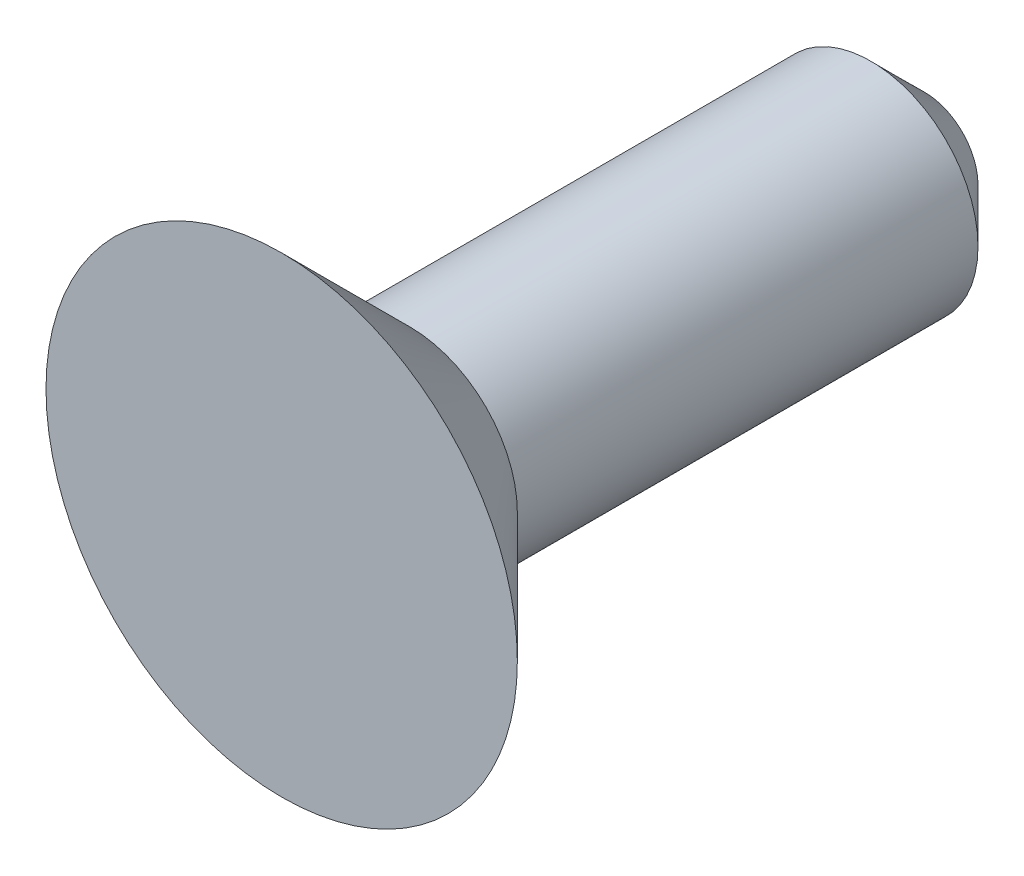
ISO-10303-21;
HEADER;
FILE_DESCRIPTION(('STEP AP214'),'2;1');
FILE_NAME('part.step','',(''),(''),'','','');
FILE_SCHEMA(('AUTOMOTIVE_DESIGN { 1 0 10303 214 1 1 1 1 }'));
ENDSEC;
DATA;
#1=APPLICATION_CONTEXT('core data for automotive mechanical design processes');
#2=APPLICATION_PROTOCOL_DEFINITION('international standard','automotive_design',2000,#1);
#3=PRODUCT_CONTEXT('',#1,'mechanical');
#4=PRODUCT('Part','Part','',(#3));
#5=PRODUCT_RELATED_PRODUCT_CATEGORY('part','',(#4));
#6=PRODUCT_DEFINITION_FORMATION('','',#4);
#7=PRODUCT_DEFINITION_CONTEXT('part definition',#1,'design');
#8=PRODUCT_DEFINITION('design','',#6,#7);
#9=PRODUCT_DEFINITION_SHAPE('','',#8);
#10=(LENGTH_UNIT() NAMED_UNIT(*) SI_UNIT(.MILLI.,.METRE.));
#11=(NAMED_UNIT(*) PLANE_ANGLE_UNIT() SI_UNIT($,.RADIAN.));
#12=(NAMED_UNIT(*) SI_UNIT($,.STERADIAN.) SOLID_ANGLE_UNIT());
#13=UNCERTAINTY_MEASURE_WITH_UNIT(LENGTH_MEASURE(1.E-05),#10,'distance_accuracy_value','');
#14=(GEOMETRIC_REPRESENTATION_CONTEXT(3) GLOBAL_UNCERTAINTY_ASSIGNED_CONTEXT((#13)) GLOBAL_UNIT_ASSIGNED_CONTEXT((#10,
#11,#12)) REPRESENTATION_CONTEXT('',''));
#15=CARTESIAN_POINT('',(0.,0.,0.));
#16=DIRECTION('',(0.,0.,1.));
#17=DIRECTION('',(1.,0.,0.));
#18=AXIS2_PLACEMENT_3D('',#15,#16,#17);
#19=CARTESIAN_POINT('',(0.,0.,-6.));
#20=DIRECTION('',(0.,0.,-1.));
#21=DIRECTION('',(-1.,0.,0.));
#22=AXIS2_PLACEMENT_3D('',#19,#20,#21);
#23=PLANE('',#22);
#24=CARTESIAN_POINT('',(0.,0.,-5.99999999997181));
#25=DIRECTION('',(0.,0.,1.));
#26=DIRECTION('',(1.,0.,0.));
#27=AXIS2_PLACEMENT_3D('',#24,#25,#26);
#28=CIRCLE('',#27,0.499999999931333);
#29=CARTESIAN_POINT('',(0.499999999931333,0.,-5.99999999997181));
#30=VERTEX_POINT('',#29);
#31=EDGE_CURVE('E17',#30,#30,#28,.T.);
#32=ORIENTED_EDGE('',*,*,#31,.F.);
#33=EDGE_LOOP('',(#32));
#34=FACE_BOUND('',#33,.T.);
#35=ADVANCED_FACE('F14',(#34),#23,.T.);
#36=CARTESIAN_POINT('',(0.,0.,-5.50000000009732));
#37=DIRECTION('',(0.,0.,1.));
#38=DIRECTION('',(1.,0.,0.));
#39=AXIS2_PLACEMENT_3D('',#36,#37,#38);
#40=CONICAL_SURFACE('',#39,0.999999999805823,0.785398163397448);
#41=CARTESIAN_POINT('',(0.,0.,-5.5));
#42=DIRECTION('',(0.,0.,-1.));
#43=DIRECTION('',(-1.,0.,0.));
#44=AXIS2_PLACEMENT_3D('',#41,#42,#43);
#45=CIRCLE('',#44,1.);
#46=CARTESIAN_POINT('',(-1.,0.,-5.5));
#47=VERTEX_POINT('',#46);
#48=EDGE_CURVE('E25',#47,#47,#45,.F.);
#49=ORIENTED_EDGE('',*,*,#48,.F.);
#50=EDGE_LOOP('',(#49));
#51=FACE_BOUND('',#50,.T.);
#52=ORIENTED_EDGE('',*,*,#31,.T.);
#53=EDGE_LOOP('',(#52));
#54=FACE_BOUND('',#53,.T.);
#55=ADVANCED_FACE('F34',(#51,#54),#40,.T.);
#56=CARTESIAN_POINT('',(0.,0.,0.));
#57=DIRECTION('',(0.,0.,-1.));
#58=DIRECTION('',(-1.,0.,0.));
#59=AXIS2_PLACEMENT_3D('',#56,#57,#58);
#60=CYLINDRICAL_SURFACE('',#59,1.);
#61=CARTESIAN_POINT('',(0.,0.,-1.19999999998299));
#62=DIRECTION('',(0.,0.,1.));
#63=DIRECTION('',(0.,1.,0.));
#64=AXIS2_PLACEMENT_3D('',#61,#62,#63);
#65=CIRCLE('',#64,0.999999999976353);
#66=CARTESIAN_POINT('',(0.,0.999999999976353,-1.19999999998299));
#67=VERTEX_POINT('',#66);
#68=EDGE_CURVE('E21',#67,#67,#65,.T.);
#69=ORIENTED_EDGE('',*,*,#68,.F.);
#70=EDGE_LOOP('',(#69));
#71=FACE_BOUND('',#70,.T.);
#72=ORIENTED_EDGE('',*,*,#48,.T.);
#73=EDGE_LOOP('',(#72));
#74=FACE_BOUND('',#73,.T.);
#75=ADVANCED_FACE('F41',(#71,#74),#60,.T.);
#76=CARTESIAN_POINT('',(0.,0.,5.6843418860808E-11));
#77=DIRECTION('',(0.,0.,1.));
#78=DIRECTION('',(1.,0.,0.));
#79=AXIS2_PLACEMENT_3D('',#76,#77,#78);
#80=CONICAL_SURFACE('',#79,2.20000000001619,0.785398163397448);
#81=ORIENTED_EDGE('',*,*,#68,.T.);
#82=EDGE_LOOP('',(#81));
#83=FACE_BOUND('',#82,.T.);
#84=CARTESIAN_POINT('',(0.,0.,5.6843418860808E-11));
#85=DIRECTION('',(0.,0.,1.));
#86=DIRECTION('',(1.,0.,0.));
#87=AXIS2_PLACEMENT_3D('',#84,#85,#86);
#88=CIRCLE('',#87,2.20000000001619);
#89=CARTESIAN_POINT('',(2.20000000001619,0.,5.6843418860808E-11));
#90=VERTEX_POINT('',#89);
#91=EDGE_CURVE('E10',#90,#90,#88,.F.);
#92=ORIENTED_EDGE('',*,*,#91,.T.);
#93=EDGE_LOOP('',(#92));
#94=FACE_BOUND('',#93,.T.);
#95=ADVANCED_FACE('F45',(#83,#94),#80,.T.);
#96=CARTESIAN_POINT('',(0.,0.,0.));
#97=DIRECTION('',(0.,0.,-1.));
#98=DIRECTION('',(-1.,0.,0.));
#99=AXIS2_PLACEMENT_3D('',#96,#97,#98);
#100=PLANE('',#99);
#101=ORIENTED_EDGE('',*,*,#91,.F.);
#102=EDGE_LOOP('',(#101));
#103=FACE_BOUND('',#102,.T.);
#104=ADVANCED_FACE('F43',(#103),#100,.F.);
#105=CLOSED_SHELL('',(#35,#55,#75,#95,#104));
#106=MANIFOLD_SOLID_BREP('B1',#105);
#107=ADVANCED_BREP_SHAPE_REPRESENTATION('',(#18,#106),#14);
#108=SHAPE_DEFINITION_REPRESENTATION(#9,#107);
ENDSEC;
END-ISO-10303-21;
